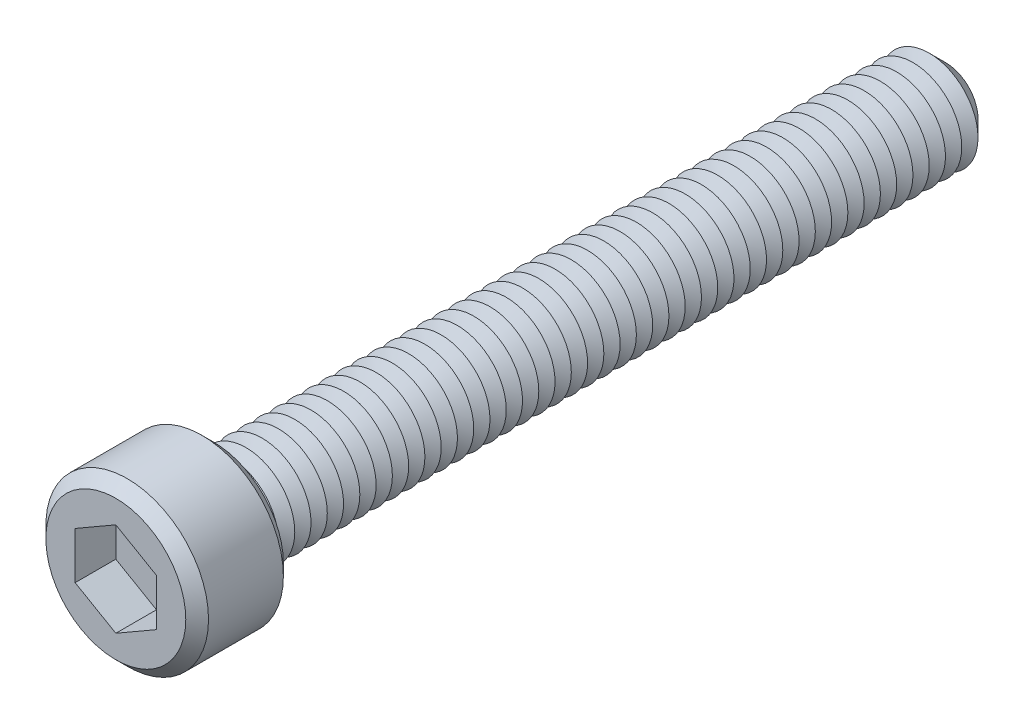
from build123d import *

# Parameters (mm, degrees)
SKETCH1_R           = 5
BOSS_EXTRUDE1_DEPTH = 6
SKETCH2_R           = 3
BOSS_EXTRUDE2_DEPTH = 45
CHAMFER1_SIZE       = 1
LPATTERN1_COUNT     = 44
LPATTERN1_PITCH     = 1
CUT_EXTRUDE1_DEPTH  = 2.5
SKETCH6_R           = 0.8
CUT_EXTRUDE2_DEPTH  = 48.5
CHAMFER2_SIZE       = 0.7


with BuildPart() as part:
    # Sketch1 → Boss-Extrude1 (new body)
    with BuildSketch(Plane.XY):
        Circle(SKETCH1_R)
    extrude(amount=BOSS_EXTRUDE1_DEPTH)

    # Sketch2 → Boss-Extrude2 (add)
    with BuildSketch(Plane(origin=(0, 0, 0), x_dir=(-1, 0, 0), z_dir=(0, 0, -1))):
        with Locations(Location((0, 0, 0), (0, 0, 180))):
            Circle(SKETCH2_R)
    extrude(amount=BOSS_EXTRUDE2_DEPTH)

    # Chamfer1
    chamfer1_edges = [part.edges().sort_by_distance(p)[0] for p in [
        (-3, 0, -45),
    ]]
    chamfer(chamfer1_edges, length=CHAMFER1_SIZE)

    # Sketch4 → Cut-Revolve1 (revolve, cut)
    with BuildSketch(Plane(origin=(0, 0, 0), x_dir=(0, 0, -1), z_dir=(1, 0, 0)), mode=Mode.PRIVATE) as cut_revolve1_sk:
        Polygon((0, 3), (0.5, 2.133974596), (1, 3), align=None)
    cut_revolve1 = revolve(cut_revolve1_sk.sketch.rotate(Axis((0, 0, 2.512122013), (0, 0, -1)), 90), axis=Axis((0, 0, 2.512122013), (0, 0, -1)), mode=Mode.SUBTRACT)

    # LPattern1: Cut-Revolve1 ×44
    with Locations(*[(0, 0, -i * LPATTERN1_PITCH) for i in range(1, LPATTERN1_COUNT)]):
        add(cut_revolve1, mode=Mode.SUBTRACT)

    # Sketch5 → Cut-Extrude1 (cut)
    with BuildSketch(Plane.XY.offset(6)):
        Polygon((0, 2.886751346), (-2.5, 1.443375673), (-2.5, -1.443375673), (0, -2.886751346), (2.5, -1.443375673), (2.5, 1.443375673), align=None)
    extrude(amount=-CUT_EXTRUDE1_DEPTH, mode=Mode.SUBTRACT)

    # Sketch6 → Cut-Extrude2 (cut)
    with BuildSketch(Plane.XY.offset(3.5)):
        Circle(SKETCH6_R)
    extrude(amount=-CUT_EXTRUDE2_DEPTH, mode=Mode.SUBTRACT)

    # Chamfer2
    chamfer2_edges = [part.edges().sort_by_distance(p)[0] for p in [
        (-5, 0, 0),
        (-5, 0, 6),
    ]]
    chamfer(chamfer2_edges, length=CHAMFER2_SIZE)


solid = part.part
